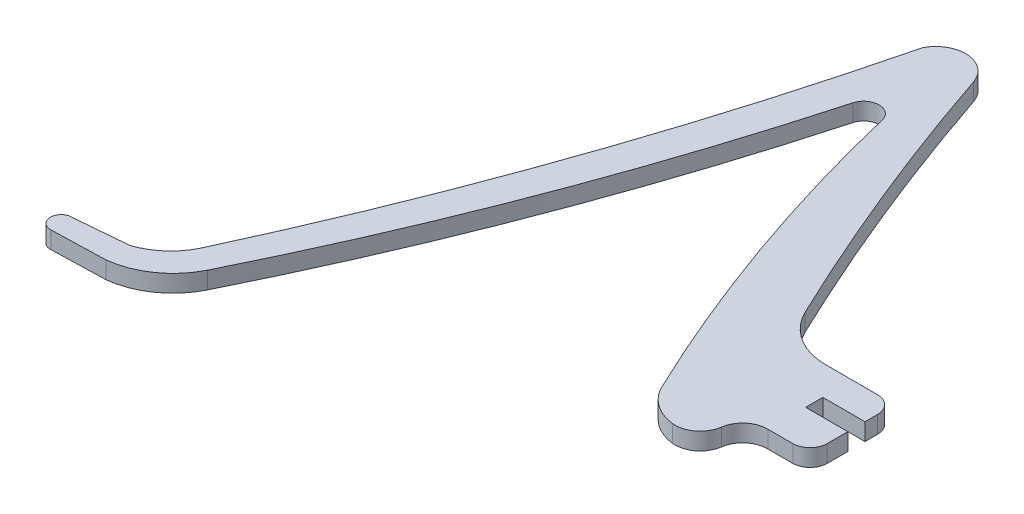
ISO-10303-21;
HEADER;
FILE_DESCRIPTION(('STEP AP214'),'2;1');
FILE_NAME('part.step','',(''),(''),'','','');
FILE_SCHEMA(('AUTOMOTIVE_DESIGN { 1 0 10303 214 1 1 1 1 }'));
ENDSEC;
DATA;
#1=APPLICATION_CONTEXT('core data for automotive mechanical design processes');
#2=APPLICATION_PROTOCOL_DEFINITION('international standard','automotive_design',2000,#1);
#3=PRODUCT_CONTEXT('',#1,'mechanical');
#4=PRODUCT('Part','Part','',(#3));
#5=PRODUCT_RELATED_PRODUCT_CATEGORY('part','',(#4));
#6=PRODUCT_DEFINITION_FORMATION('','',#4);
#7=PRODUCT_DEFINITION_CONTEXT('part definition',#1,'design');
#8=PRODUCT_DEFINITION('design','',#6,#7);
#9=PRODUCT_DEFINITION_SHAPE('','',#8);
#10=(LENGTH_UNIT() NAMED_UNIT(*) SI_UNIT(.MILLI.,.METRE.));
#11=(NAMED_UNIT(*) PLANE_ANGLE_UNIT() SI_UNIT($,.RADIAN.));
#12=(NAMED_UNIT(*) SI_UNIT($,.STERADIAN.) SOLID_ANGLE_UNIT());
#13=UNCERTAINTY_MEASURE_WITH_UNIT(LENGTH_MEASURE(1.E-05),#10,'distance_accuracy_value','');
#14=(GEOMETRIC_REPRESENTATION_CONTEXT(3) GLOBAL_UNCERTAINTY_ASSIGNED_CONTEXT((#13)) GLOBAL_UNIT_ASSIGNED_CONTEXT((#10,
#11,#12)) REPRESENTATION_CONTEXT('',''));
#15=CARTESIAN_POINT('',(0.,0.,0.));
#16=DIRECTION('',(0.,0.,1.));
#17=DIRECTION('',(1.,0.,0.));
#18=AXIS2_PLACEMENT_3D('',#15,#16,#17);
#19=CARTESIAN_POINT('',(-41736.5703119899,3.,-18202.859375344));
#20=DIRECTION('',(0.,-1.,0.));
#21=DIRECTION('',(0.,0.,-1.));
#22=AXIS2_PLACEMENT_3D('',#19,#20,#21);
#23=CYLINDRICAL_SURFACE('',#22,1.87725099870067);
#24=CARTESIAN_POINT('',(-41736.5703119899,0.,-18202.859375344));
#25=DIRECTION('',(0.,1.,0.));
#26=DIRECTION('',(0.,0.,1.));
#27=AXIS2_PLACEMENT_3D('',#24,#25,#26);
#28=CIRCLE('',#27,1.87725099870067);
#29=CARTESIAN_POINT('',(-41736.402871,0.,-18204.729144));
#30=VERTEX_POINT('',#29);
#31=CARTESIAN_POINT('',(-41736.517584,0.,-18200.982865));
#32=VERTEX_POINT('',#31);
#33=EDGE_CURVE('E228',#30,#32,#28,.T.);
#34=ORIENTED_EDGE('',*,*,#33,.T.);
#35=DIRECTION('',(0.,-1.,0.));
#36=VECTOR('',#35,1.);
#37=CARTESIAN_POINT('',(-41736.517584,3.,-18200.982865));
#38=LINE('',#37,#36);
#39=CARTESIAN_POINT('',(-41736.517584,3.,-18200.982865));
#40=VERTEX_POINT('',#39);
#41=EDGE_CURVE('E11',#40,#32,#38,.T.);
#42=ORIENTED_EDGE('',*,*,#41,.F.);
#43=CARTESIAN_POINT('',(-41736.5703119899,3.,-18202.859375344));
#44=DIRECTION('',(0.,1.,0.));
#45=DIRECTION('',(0.,0.,1.));
#46=AXIS2_PLACEMENT_3D('',#43,#44,#45);
#47=CIRCLE('',#46,1.87725099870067);
#48=CARTESIAN_POINT('',(-41736.402871,3.,-18204.729144));
#49=VERTEX_POINT('',#48);
#50=EDGE_CURVE('E274',#49,#40,#47,.T.);
#51=ORIENTED_EDGE('',*,*,#50,.F.);
#52=DIRECTION('',(0.,-1.,0.));
#53=VECTOR('',#52,1.);
#54=CARTESIAN_POINT('',(-41736.402871,3.,-18204.729144));
#55=LINE('',#54,#53);
#56=EDGE_CURVE('E224',#49,#30,#55,.T.);
#57=ORIENTED_EDGE('',*,*,#56,.T.);
#58=EDGE_LOOP('',(#34,#42,#51,#57));
#59=FACE_BOUND('',#58,.T.);
#60=ADVANCED_FACE('F36',(#59),#23,.T.);
#61=CARTESIAN_POINT('',(-41736.517584,3.,-18200.982865));
#62=DIRECTION('',(-0.0281516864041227,0.,-0.999603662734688));
#63=DIRECTION('',(-0.999603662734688,0.,0.0281516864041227));
#64=AXIS2_PLACEMENT_3D('',#61,#62,#63);
#65=PLANE('',#64);
#66=DIRECTION('',(0.999603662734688,0.,-0.0281516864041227));
#67=VECTOR('',#66,1.);
#68=CARTESIAN_POINT('',(-41736.517584,0.,-18200.982865));
#69=LINE('',#68,#67);
#70=CARTESIAN_POINT('',(-41727.101562,0.,-18201.248047));
#71=VERTEX_POINT('',#70);
#72=EDGE_CURVE('E231',#32,#71,#69,.T.);
#73=ORIENTED_EDGE('',*,*,#72,.T.);
#74=DIRECTION('',(0.,-1.,0.));
#75=VECTOR('',#74,1.);
#76=CARTESIAN_POINT('',(-41727.101562,3.,-18201.248047));
#77=LINE('',#76,#75);
#78=CARTESIAN_POINT('',(-41727.101562,3.,-18201.248047));
#79=VERTEX_POINT('',#78);
#80=EDGE_CURVE('E44',#79,#71,#77,.T.);
#81=ORIENTED_EDGE('',*,*,#80,.F.);
#82=DIRECTION('',(0.999603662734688,0.,-0.0281516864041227));
#83=VECTOR('',#82,1.);
#84=CARTESIAN_POINT('',(-41736.517584,3.,-18200.982865));
#85=LINE('',#84,#83);
#86=EDGE_CURVE('E143',#40,#79,#85,.T.);
#87=ORIENTED_EDGE('',*,*,#86,.F.);
#88=ORIENTED_EDGE('',*,*,#41,.T.);
#89=EDGE_LOOP('',(#73,#81,#87,#88));
#90=FACE_BOUND('',#89,.T.);
#91=ADVANCED_FACE('F412',(#90),#65,.F.);
#92=CARTESIAN_POINT('',(-41728.6495248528,3.,-18214.4523570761));
#93=DIRECTION('',(0.,-1.,0.));
#94=DIRECTION('',(0.,0.,-1.));
#95=AXIS2_PLACEMENT_3D('',#92,#93,#94);
#96=CYLINDRICAL_SURFACE('',#95,13.2947355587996);
#97=CARTESIAN_POINT('',(-41728.6495248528,0.,-18214.4523570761));
#98=DIRECTION('',(0.,1.,0.));
#99=DIRECTION('',(0.,0.,1.));
#100=AXIS2_PLACEMENT_3D('',#97,#98,#99);
#101=CIRCLE('',#100,13.2947355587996);
#102=CARTESIAN_POINT('',(-41716.7257579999,0.,-18208.57241));
#103=VERTEX_POINT('',#102);
#104=EDGE_CURVE('E233',#71,#103,#101,.T.);
#105=ORIENTED_EDGE('',*,*,#104,.T.);
#106=DIRECTION('',(0.,-1.,0.));
#107=VECTOR('',#106,1.);
#108=CARTESIAN_POINT('',(-41716.7257579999,3.,-18208.57241));
#109=LINE('',#108,#107);
#110=CARTESIAN_POINT('',(-41716.7257579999,3.,-18208.57241));
#111=VERTEX_POINT('',#110);
#112=EDGE_CURVE('E329',#111,#103,#109,.T.);
#113=ORIENTED_EDGE('',*,*,#112,.F.);
#114=CARTESIAN_POINT('',(-41728.6495248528,3.,-18214.4523570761));
#115=DIRECTION('',(0.,1.,0.));
#116=DIRECTION('',(0.,0.,1.));
#117=AXIS2_PLACEMENT_3D('',#114,#115,#116);
#118=CIRCLE('',#117,13.2947355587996);
#119=EDGE_CURVE('E337',#79,#111,#118,.T.);
#120=ORIENTED_EDGE('',*,*,#119,.F.);
#121=ORIENTED_EDGE('',*,*,#80,.T.);
#122=EDGE_LOOP('',(#105,#113,#120,#121));
#123=FACE_BOUND('',#122,.T.);
#124=ADVANCED_FACE('F335',(#123),#96,.T.);
#125=CARTESIAN_POINT('',(-42129.610875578,3.,-18412.1957815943));
#126=DIRECTION('',(0.,-1.,0.));
#127=DIRECTION('',(0.,0.,-1.));
#128=AXIS2_PLACEMENT_3D('',#125,#126,#127);
#129=CYLINDRICAL_SURFACE('',#128,460.365721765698);
#130=CARTESIAN_POINT('',(-42129.610875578,0.,-18412.1957815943));
#131=DIRECTION('',(0.,1.,0.));
#132=DIRECTION('',(0.,0.,1.));
#133=AXIS2_PLACEMENT_3D('',#130,#131,#132);
#134=CIRCLE('',#133,460.365721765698);
#135=CARTESIAN_POINT('',(-41685.712916,0.,-18290.1662800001));
#136=VERTEX_POINT('',#135);
#137=EDGE_CURVE('E235',#103,#136,#134,.T.);
#138=ORIENTED_EDGE('',*,*,#137,.T.);
#139=DIRECTION('',(0.,-1.,0.));
#140=VECTOR('',#139,1.);
#141=CARTESIAN_POINT('',(-41685.712916,3.,-18290.1662800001));
#142=LINE('',#141,#140);
#143=CARTESIAN_POINT('',(-41685.712916,3.,-18290.1662800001));
#144=VERTEX_POINT('',#143);
#145=EDGE_CURVE('E326',#144,#136,#142,.T.);
#146=ORIENTED_EDGE('',*,*,#145,.F.);
#147=CARTESIAN_POINT('',(-42129.610875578,3.,-18412.1957815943));
#148=DIRECTION('',(0.,1.,0.));
#149=DIRECTION('',(0.,0.,1.));
#150=AXIS2_PLACEMENT_3D('',#147,#148,#149);
#151=CIRCLE('',#150,460.365721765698);
#152=EDGE_CURVE('E355',#111,#144,#151,.T.);
#153=ORIENTED_EDGE('',*,*,#152,.F.);
#154=ORIENTED_EDGE('',*,*,#112,.T.);
#155=EDGE_LOOP('',(#138,#146,#153,#154));
#156=FACE_BOUND('',#155,.T.);
#157=ADVANCED_FACE('F346',(#156),#129,.T.);
#158=CARTESIAN_POINT('',(-41683.1202207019,3.,-18289.4531815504));
#159=DIRECTION('',(0.,-1.,0.));
#160=DIRECTION('',(0.,0.,-1.));
#161=AXIS2_PLACEMENT_3D('',#158,#159,#160);
#162=CYLINDRICAL_SURFACE('',#161,2.68897346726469);
#163=CARTESIAN_POINT('',(-41683.1202207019,0.,-18289.4531815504));
#164=DIRECTION('',(0.,-1.,0.));
#165=DIRECTION('',(0.,0.,1.));
#166=AXIS2_PLACEMENT_3D('',#163,#164,#165);
#167=CIRCLE('',#166,2.68897346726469);
#168=CARTESIAN_POINT('',(-41680.641146,0.,-18290.494703));
#169=VERTEX_POINT('',#168);
#170=EDGE_CURVE('E237',#136,#169,#167,.T.);
#171=ORIENTED_EDGE('',*,*,#170,.T.);
#172=DIRECTION('',(0.,-1.,0.));
#173=VECTOR('',#172,1.);
#174=CARTESIAN_POINT('',(-41680.641146,3.,-18290.494703));
#175=LINE('',#174,#173);
#176=CARTESIAN_POINT('',(-41680.641146,3.,-18290.494703));
#177=VERTEX_POINT('',#176);
#178=EDGE_CURVE('E323',#177,#169,#175,.T.);
#179=ORIENTED_EDGE('',*,*,#178,.F.);
#180=CARTESIAN_POINT('',(-41683.1202207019,3.,-18289.4531815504));
#181=DIRECTION('',(0.,-1.,0.));
#182=DIRECTION('',(0.,0.,1.));
#183=AXIS2_PLACEMENT_3D('',#180,#181,#182);
#184=CIRCLE('',#183,2.68897346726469);
#185=EDGE_CURVE('E352',#144,#177,#184,.T.);
#186=ORIENTED_EDGE('',*,*,#185,.F.);
#187=ORIENTED_EDGE('',*,*,#145,.T.);
#188=EDGE_LOOP('',(#171,#179,#186,#187));
#189=FACE_BOUND('',#188,.T.);
#190=ADVANCED_FACE('F350',(#189),#162,.F.);
#191=CARTESIAN_POINT('',(-41388.5252984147,3.,-18360.1380724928));
#192=DIRECTION('',(0.,-1.,0.));
#193=DIRECTION('',(0.,0.,-1.));
#194=AXIS2_PLACEMENT_3D('',#191,#192,#193);
#195=CYLINDRICAL_SURFACE('',#194,300.302959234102);
#196=CARTESIAN_POINT('',(-41388.5252984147,0.,-18360.1380724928));
#197=DIRECTION('',(0.,1.,0.));
#198=DIRECTION('',(0.,0.,1.));
#199=AXIS2_PLACEMENT_3D('',#196,#197,#198);
#200=CIRCLE('',#199,300.302959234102);
#201=CARTESIAN_POINT('',(-41659.432339,0.,-18230.5570450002));
#202=VERTEX_POINT('',#201);
#203=EDGE_CURVE('E239',#169,#202,#200,.T.);
#204=ORIENTED_EDGE('',*,*,#203,.T.);
#205=DIRECTION('',(0.,-1.,0.));
#206=VECTOR('',#205,1.);
#207=CARTESIAN_POINT('',(-41659.432339,3.,-18230.5570450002));
#208=LINE('',#207,#206);
#209=CARTESIAN_POINT('',(-41659.432339,3.,-18230.5570450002));
#210=VERTEX_POINT('',#209);
#211=EDGE_CURVE('E320',#210,#202,#208,.T.);
#212=ORIENTED_EDGE('',*,*,#211,.F.);
#213=CARTESIAN_POINT('',(-41388.5252984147,3.,-18360.1380724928));
#214=DIRECTION('',(0.,1.,0.));
#215=DIRECTION('',(0.,0.,1.));
#216=AXIS2_PLACEMENT_3D('',#213,#214,#215);
#217=CIRCLE('',#216,300.302959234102);
#218=EDGE_CURVE('E354',#177,#210,#217,.T.);
#219=ORIENTED_EDGE('',*,*,#218,.F.);
#220=ORIENTED_EDGE('',*,*,#178,.T.);
#221=EDGE_LOOP('',(#204,#212,#219,#220));
#222=FACE_BOUND('',#221,.T.);
#223=ADVANCED_FACE('F425',(#222),#195,.T.);
#224=CARTESIAN_POINT('',(-41652.049504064,3.,-18234.0869775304));
#225=DIRECTION('',(0.,-1.,0.));
#226=DIRECTION('',(0.,0.,-1.));
#227=AXIS2_PLACEMENT_3D('',#224,#225,#226);
#228=CYLINDRICAL_SURFACE('',#227,8.18331689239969);
#229=CARTESIAN_POINT('',(-41652.049504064,0.,-18234.0869775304));
#230=DIRECTION('',(0.,1.,0.));
#231=DIRECTION('',(0.,0.,1.));
#232=AXIS2_PLACEMENT_3D('',#229,#230,#231);
#233=CIRCLE('',#232,8.18331689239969);
#234=CARTESIAN_POINT('',(-41653.00576,0.,-18225.9597240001));
#235=VERTEX_POINT('',#234);
#236=EDGE_CURVE('E241',#202,#235,#233,.T.);
#237=ORIENTED_EDGE('',*,*,#236,.T.);
#238=DIRECTION('',(0.,-1.,0.));
#239=VECTOR('',#238,1.);
#240=CARTESIAN_POINT('',(-41653.00576,3.,-18225.9597240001));
#241=LINE('',#240,#239);
#242=CARTESIAN_POINT('',(-41653.00576,3.,-18225.9597240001));
#243=VERTEX_POINT('',#242);
#244=EDGE_CURVE('E317',#243,#235,#241,.T.);
#245=ORIENTED_EDGE('',*,*,#244,.F.);
#246=CARTESIAN_POINT('',(-41652.049504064,3.,-18234.0869775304));
#247=DIRECTION('',(0.,1.,0.));
#248=DIRECTION('',(0.,0.,1.));
#249=AXIS2_PLACEMENT_3D('',#246,#247,#248);
#250=CIRCLE('',#249,8.18331689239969);
#251=EDGE_CURVE('E357',#210,#243,#250,.T.);
#252=ORIENTED_EDGE('',*,*,#251,.F.);
#253=ORIENTED_EDGE('',*,*,#211,.T.);
#254=EDGE_LOOP('',(#237,#245,#252,#253));
#255=FACE_BOUND('',#254,.T.);
#256=ADVANCED_FACE('F428',(#255),#228,.T.);
#257=CARTESIAN_POINT('',(-41652.4920338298,3.,-18230.2989458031));
#258=DIRECTION('',(0.,-1.,0.));
#259=DIRECTION('',(0.,0.,-1.));
#260=AXIS2_PLACEMENT_3D('',#257,#258,#259);
#261=CYLINDRICAL_SURFACE('',#260,4.36952633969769);
#262=CARTESIAN_POINT('',(-41652.4920338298,0.,-18230.2989458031));
#263=DIRECTION('',(0.,1.,0.));
#264=DIRECTION('',(0.,0.,1.));
#265=AXIS2_PLACEMENT_3D('',#262,#263,#264);
#266=CIRCLE('',#265,4.36952633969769);
#267=CARTESIAN_POINT('',(-41648.166319,0.,-18229.681733));
#268=VERTEX_POINT('',#267);
#269=EDGE_CURVE('E243',#235,#268,#266,.T.);
#270=ORIENTED_EDGE('',*,*,#269,.T.);
#271=DIRECTION('',(0.,-1.,0.));
#272=VECTOR('',#271,1.);
#273=CARTESIAN_POINT('',(-41648.166319,3.,-18229.681733));
#274=LINE('',#273,#272);
#275=CARTESIAN_POINT('',(-41648.166319,3.,-18229.681733));
#276=VERTEX_POINT('',#275);
#277=EDGE_CURVE('E314',#276,#268,#274,.T.);
#278=ORIENTED_EDGE('',*,*,#277,.F.);
#279=CARTESIAN_POINT('',(-41652.4920338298,3.,-18230.2989458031));
#280=DIRECTION('',(0.,1.,0.));
#281=DIRECTION('',(0.,0.,1.));
#282=AXIS2_PLACEMENT_3D('',#279,#280,#281);
#283=CIRCLE('',#282,4.36952633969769);
#284=EDGE_CURVE('E363',#243,#276,#283,.T.);
#285=ORIENTED_EDGE('',*,*,#284,.F.);
#286=ORIENTED_EDGE('',*,*,#244,.T.);
#287=EDGE_LOOP('',(#270,#278,#285,#286));
#288=FACE_BOUND('',#287,.T.);
#289=ADVANCED_FACE('F432',(#288),#261,.T.);
#290=CARTESIAN_POINT('',(-41643.8549400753,3.,-18229.0668609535));
#291=DIRECTION('',(0.,-1.,0.));
#292=DIRECTION('',(0.,0.,-1.));
#293=AXIS2_PLACEMENT_3D('',#290,#291,#292);
#294=CYLINDRICAL_SURFACE('',#293,4.35500354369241);
#295=CARTESIAN_POINT('',(-41643.8549400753,0.,-18229.0668609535));
#296=DIRECTION('',(0.,-1.,0.));
#297=DIRECTION('',(0.,0.,1.));
#298=AXIS2_PLACEMENT_3D('',#295,#296,#297);
#299=CIRCLE('',#298,4.35500354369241);
#300=CARTESIAN_POINT('',(-41643.818257,0.,-18233.42171));
#301=VERTEX_POINT('',#300);
#302=EDGE_CURVE('E245',#268,#301,#299,.T.);
#303=ORIENTED_EDGE('',*,*,#302,.T.);
#304=DIRECTION('',(0.,-1.,0.));
#305=VECTOR('',#304,1.);
#306=CARTESIAN_POINT('',(-41643.818257,3.,-18233.42171));
#307=LINE('',#306,#305);
#308=CARTESIAN_POINT('',(-41643.818257,3.,-18233.42171));
#309=VERTEX_POINT('',#308);
#310=EDGE_CURVE('E311',#309,#301,#307,.T.);
#311=ORIENTED_EDGE('',*,*,#310,.F.);
#312=CARTESIAN_POINT('',(-41643.8549400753,3.,-18229.0668609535));
#313=DIRECTION('',(0.,-1.,0.));
#314=DIRECTION('',(0.,0.,1.));
#315=AXIS2_PLACEMENT_3D('',#312,#313,#314);
#316=CIRCLE('',#315,4.35500354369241);
#317=EDGE_CURVE('E365',#276,#309,#316,.T.);
#318=ORIENTED_EDGE('',*,*,#317,.F.);
#319=ORIENTED_EDGE('',*,*,#277,.T.);
#320=EDGE_LOOP('',(#303,#311,#318,#319));
#321=FACE_BOUND('',#320,.T.);
#322=ADVANCED_FACE('F436',(#321),#294,.F.);
#323=CARTESIAN_POINT('',(-41643.818257,3.,-18233.42171));
#324=DIRECTION('',(-0.000483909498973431,0.,-0.999999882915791));
#325=DIRECTION('',(-0.999999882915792,0.,0.000483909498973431));
#326=AXIS2_PLACEMENT_3D('',#323,#324,#325);
#327=PLANE('',#326);
#328=DIRECTION('',(0.999999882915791,0.,-0.000483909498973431));
#329=VECTOR('',#328,1.);
#330=CARTESIAN_POINT('',(-41643.818257,0.,-18233.42171));
#331=LINE('',#330,#329);
#332=CARTESIAN_POINT('',(-41639.441406,0.,-18233.423828));
#333=VERTEX_POINT('',#332);
#334=EDGE_CURVE('E247',#301,#333,#331,.T.);
#335=ORIENTED_EDGE('',*,*,#334,.T.);
#336=DIRECTION('',(0.,-1.,0.));
#337=VECTOR('',#336,1.);
#338=CARTESIAN_POINT('',(-41639.441406,3.,-18233.423828));
#339=LINE('',#338,#337);
#340=CARTESIAN_POINT('',(-41639.441406,3.,-18233.423828));
#341=VERTEX_POINT('',#340);
#342=EDGE_CURVE('E308',#341,#333,#339,.T.);
#343=ORIENTED_EDGE('',*,*,#342,.F.);
#344=DIRECTION('',(0.999999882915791,0.,-0.000483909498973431));
#345=VECTOR('',#344,1.);
#346=CARTESIAN_POINT('',(-41643.818257,3.,-18233.42171));
#347=LINE('',#346,#345);
#348=EDGE_CURVE('E367',#309,#341,#347,.T.);
#349=ORIENTED_EDGE('',*,*,#348,.F.);
#350=ORIENTED_EDGE('',*,*,#310,.T.);
#351=EDGE_LOOP('',(#335,#343,#349,#350));
#352=FACE_BOUND('',#351,.T.);
#353=ADVANCED_FACE('F440',(#352),#327,.F.);
#354=CARTESIAN_POINT('',(-41639.4423819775,3.,-18236.4248038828));
#355=DIRECTION('',(0.,-1.,0.));
#356=DIRECTION('',(0.,0.,-1.));
#357=AXIS2_PLACEMENT_3D('',#354,#355,#356);
#358=CYLINDRICAL_SURFACE('',#357,3.00097604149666);
#359=CARTESIAN_POINT('',(-41639.4423819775,0.,-18236.4248038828));
#360=DIRECTION('',(0.,1.,0.));
#361=DIRECTION('',(0.,0.,1.));
#362=AXIS2_PLACEMENT_3D('',#359,#360,#361);
#363=CIRCLE('',#362,3.00097604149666);
#364=CARTESIAN_POINT('',(-41636.441407,0.,-18236.427331));
#365=VERTEX_POINT('',#364);
#366=EDGE_CURVE('E249',#333,#365,#363,.T.);
#367=ORIENTED_EDGE('',*,*,#366,.T.);
#368=DIRECTION('',(0.,-1.,0.));
#369=VECTOR('',#368,1.);
#370=CARTESIAN_POINT('',(-41636.441407,3.,-18236.427331));
#371=LINE('',#370,#369);
#372=CARTESIAN_POINT('',(-41636.441407,3.,-18236.427331));
#373=VERTEX_POINT('',#372);
#374=EDGE_CURVE('E305',#373,#365,#371,.T.);
#375=ORIENTED_EDGE('',*,*,#374,.F.);
#376=CARTESIAN_POINT('',(-41639.4423819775,3.,-18236.4248038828));
#377=DIRECTION('',(0.,1.,0.));
#378=DIRECTION('',(0.,0.,1.));
#379=AXIS2_PLACEMENT_3D('',#376,#377,#378);
#380=CIRCLE('',#379,3.00097604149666);
#381=EDGE_CURVE('E369',#341,#373,#380,.T.);
#382=ORIENTED_EDGE('',*,*,#381,.F.);
#383=ORIENTED_EDGE('',*,*,#342,.T.);
#384=EDGE_LOOP('',(#367,#375,#382,#383));
#385=FACE_BOUND('',#384,.T.);
#386=ADVANCED_FACE('F444',(#385),#358,.T.);
#387=CARTESIAN_POINT('',(-41636.441407,3.,-18236.427331));
#388=DIRECTION('',(-0.999999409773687,0.,0.00108648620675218));
#389=DIRECTION('',(0.00108648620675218,0.,0.999999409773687));
#390=AXIS2_PLACEMENT_3D('',#387,#388,#389);
#391=PLANE('',#390);
#392=DIRECTION('',(-0.00108648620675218,0.,-0.999999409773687));
#393=VECTOR('',#392,1.);
#394=CARTESIAN_POINT('',(-41636.441407,0.,-18236.427331));
#395=LINE('',#394,#393);
#396=CARTESIAN_POINT('',(-41636.445312,0.,-18240.021484));
#397=VERTEX_POINT('',#396);
#398=EDGE_CURVE('E251',#365,#397,#395,.T.);
#399=ORIENTED_EDGE('',*,*,#398,.T.);
#400=DIRECTION('',(0.,-1.,0.));
#401=VECTOR('',#400,1.);
#402=CARTESIAN_POINT('',(-41636.445312,3.,-18240.021484));
#403=LINE('',#402,#401);
#404=CARTESIAN_POINT('',(-41636.445312,3.,-18240.021484));
#405=VERTEX_POINT('',#404);
#406=EDGE_CURVE('E302',#405,#397,#403,.T.);
#407=ORIENTED_EDGE('',*,*,#406,.F.);
#408=DIRECTION('',(-0.00108648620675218,0.,-0.999999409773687));
#409=VECTOR('',#408,1.);
#410=CARTESIAN_POINT('',(-41636.441407,3.,-18236.427331));
#411=LINE('',#410,#409);
#412=EDGE_CURVE('E371',#373,#405,#411,.T.);
#413=ORIENTED_EDGE('',*,*,#412,.F.);
#414=ORIENTED_EDGE('',*,*,#374,.T.);
#415=EDGE_LOOP('',(#399,#407,#413,#414));
#416=FACE_BOUND('',#415,.T.);
#417=ADVANCED_FACE('F448',(#416),#391,.F.);
#418=CARTESIAN_POINT('',(-41636.445312,3.,-18240.021484));
#419=DIRECTION('',(0.,0.,1.));
#420=DIRECTION('',(1.,0.,0.));
#421=AXIS2_PLACEMENT_3D('',#418,#419,#420);
#422=PLANE('',#421);
#423=DIRECTION('',(-1.,0.,0.));
#424=VECTOR('',#423,1.);
#425=CARTESIAN_POINT('',(-41636.445312,0.,-18240.021484));
#426=LINE('',#425,#424);
#427=CARTESIAN_POINT('',(-41643.804687,0.,-18240.021484));
#428=VERTEX_POINT('',#427);
#429=EDGE_CURVE('E253',#397,#428,#426,.T.);
#430=ORIENTED_EDGE('',*,*,#429,.T.);
#431=DIRECTION('',(0.,-1.,0.));
#432=VECTOR('',#431,1.);
#433=CARTESIAN_POINT('',(-41643.804687,3.,-18240.021484));
#434=LINE('',#433,#432);
#435=CARTESIAN_POINT('',(-41643.804687,3.,-18240.021484));
#436=VERTEX_POINT('',#435);
#437=EDGE_CURVE('E299',#436,#428,#434,.T.);
#438=ORIENTED_EDGE('',*,*,#437,.F.);
#439=DIRECTION('',(-1.,0.,0.));
#440=VECTOR('',#439,1.);
#441=CARTESIAN_POINT('',(-41636.445312,3.,-18240.021484));
#442=LINE('',#441,#440);
#443=EDGE_CURVE('E373',#405,#436,#442,.T.);
#444=ORIENTED_EDGE('',*,*,#443,.F.);
#445=ORIENTED_EDGE('',*,*,#406,.T.);
#446=EDGE_LOOP('',(#430,#438,#444,#445));
#447=FACE_BOUND('',#446,.T.);
#448=ADVANCED_FACE('F452',(#447),#422,.F.);
#449=CARTESIAN_POINT('',(-41643.804687,3.,-18240.021484));
#450=DIRECTION('',(-0.999999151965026,0.,0.00130233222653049));
#451=DIRECTION('',(0.00130233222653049,0.,0.999999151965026));
#452=AXIS2_PLACEMENT_3D('',#449,#450,#451);
#453=PLANE('',#452);
#454=DIRECTION('',(-0.00130233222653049,0.,-0.999999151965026));
#455=VECTOR('',#454,1.);
#456=CARTESIAN_POINT('',(-41643.804687,0.,-18240.021484));
#457=LINE('',#456,#455);
#458=CARTESIAN_POINT('',(-41643.808594,0.,-18243.021484));
#459=VERTEX_POINT('',#458);
#460=EDGE_CURVE('E255',#428,#459,#457,.T.);
#461=ORIENTED_EDGE('',*,*,#460,.T.);
#462=DIRECTION('',(0.,-1.,0.));
#463=VECTOR('',#462,1.);
#464=CARTESIAN_POINT('',(-41643.808594,3.,-18243.021484));
#465=LINE('',#464,#463);
#466=CARTESIAN_POINT('',(-41643.808594,3.,-18243.021484));
#467=VERTEX_POINT('',#466);
#468=EDGE_CURVE('E296',#467,#459,#465,.T.);
#469=ORIENTED_EDGE('',*,*,#468,.F.);
#470=DIRECTION('',(-0.00130233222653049,0.,-0.999999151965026));
#471=VECTOR('',#470,1.);
#472=CARTESIAN_POINT('',(-41643.804687,3.,-18240.021484));
#473=LINE('',#472,#471);
#474=EDGE_CURVE('E375',#436,#467,#473,.T.);
#475=ORIENTED_EDGE('',*,*,#474,.F.);
#476=ORIENTED_EDGE('',*,*,#437,.T.);
#477=EDGE_LOOP('',(#461,#469,#475,#476));
#478=FACE_BOUND('',#477,.T.);
#479=ADVANCED_FACE('F456',(#478),#453,.F.);
#480=CARTESIAN_POINT('',(-41643.808594,3.,-18243.021484));
#481=DIRECTION('',(0.,0.,-1.));
#482=DIRECTION('',(-1.,0.,0.));
#483=AXIS2_PLACEMENT_3D('',#480,#481,#482);
#484=PLANE('',#483);
#485=DIRECTION('',(1.,0.,0.));
#486=VECTOR('',#485,1.);
#487=CARTESIAN_POINT('',(-41643.808594,0.,-18243.021484));
#488=LINE('',#487,#486);
#489=CARTESIAN_POINT('',(-41636.449219,0.,-18243.021484));
#490=VERTEX_POINT('',#489);
#491=EDGE_CURVE('E257',#459,#490,#488,.T.);
#492=ORIENTED_EDGE('',*,*,#491,.T.);
#493=DIRECTION('',(0.,-1.,0.));
#494=VECTOR('',#493,1.);
#495=CARTESIAN_POINT('',(-41636.449219,3.,-18243.021484));
#496=LINE('',#495,#494);
#497=CARTESIAN_POINT('',(-41636.449219,3.,-18243.021484));
#498=VERTEX_POINT('',#497);
#499=EDGE_CURVE('E293',#498,#490,#496,.T.);
#500=ORIENTED_EDGE('',*,*,#499,.F.);
#501=DIRECTION('',(1.,0.,0.));
#502=VECTOR('',#501,1.);
#503=CARTESIAN_POINT('',(-41643.808594,3.,-18243.021484));
#504=LINE('',#503,#502);
#505=EDGE_CURVE('E377',#467,#498,#504,.T.);
#506=ORIENTED_EDGE('',*,*,#505,.F.);
#507=ORIENTED_EDGE('',*,*,#468,.T.);
#508=EDGE_LOOP('',(#492,#500,#506,#507));
#509=FACE_BOUND('',#508,.T.);
#510=ADVANCED_FACE('F460',(#509),#484,.F.);
#511=CARTESIAN_POINT('',(-41636.449219,3.,-18243.021484));
#512=DIRECTION('',(-0.999998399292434,0.,-0.00178924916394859));
#513=DIRECTION('',(-0.00178924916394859,0.,0.999998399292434));
#514=AXIS2_PLACEMENT_3D('',#511,#512,#513);
#515=PLANE('',#514);
#516=DIRECTION('',(0.00178924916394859,0.,-0.999998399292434));
#517=VECTOR('',#516,1.);
#518=CARTESIAN_POINT('',(-41636.449219,0.,-18243.021484));
#519=LINE('',#518,#517);
#520=CARTESIAN_POINT('',(-41636.445312,0.,-18245.205078));
#521=VERTEX_POINT('',#520);
#522=EDGE_CURVE('E259',#490,#521,#519,.T.);
#523=ORIENTED_EDGE('',*,*,#522,.T.);
#524=DIRECTION('',(0.,-1.,0.));
#525=VECTOR('',#524,1.);
#526=CARTESIAN_POINT('',(-41636.445312,3.,-18245.205078));
#527=LINE('',#526,#525);
#528=CARTESIAN_POINT('',(-41636.445312,3.,-18245.205078));
#529=VERTEX_POINT('',#528);
#530=EDGE_CURVE('E290',#529,#521,#527,.T.);
#531=ORIENTED_EDGE('',*,*,#530,.F.);
#532=DIRECTION('',(0.00178924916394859,0.,-0.999998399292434));
#533=VECTOR('',#532,1.);
#534=CARTESIAN_POINT('',(-41636.449219,3.,-18243.021484));
#535=LINE('',#534,#533);
#536=EDGE_CURVE('E379',#498,#529,#535,.T.);
#537=ORIENTED_EDGE('',*,*,#536,.F.);
#538=ORIENTED_EDGE('',*,*,#499,.T.);
#539=EDGE_LOOP('',(#523,#531,#537,#538));
#540=FACE_BOUND('',#539,.T.);
#541=ADVANCED_FACE('F464',(#540),#515,.F.);
#542=CARTESIAN_POINT('',(-41639.445312,3.,-18245.205078));
#543=DIRECTION('',(0.,-1.,0.));
#544=DIRECTION('',(0.,0.,-1.));
#545=AXIS2_PLACEMENT_3D('',#542,#543,#544);
#546=CYLINDRICAL_SURFACE('',#545,3.0000000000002);
#547=CARTESIAN_POINT('',(-41639.445312,0.,-18245.205078));
#548=DIRECTION('',(0.,1.,0.));
#549=DIRECTION('',(0.,0.,1.));
#550=AXIS2_PLACEMENT_3D('',#547,#548,#549);
#551=CIRCLE('',#550,3.0000000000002);
#552=CARTESIAN_POINT('',(-41639.445313,0.,-18248.205078));
#553=VERTEX_POINT('',#552);
#554=EDGE_CURVE('E261',#521,#553,#551,.T.);
#555=ORIENTED_EDGE('',*,*,#554,.T.);
#556=DIRECTION('',(0.,-1.,0.));
#557=VECTOR('',#556,1.);
#558=CARTESIAN_POINT('',(-41639.445313,3.,-18248.205078));
#559=LINE('',#558,#557);
#560=CARTESIAN_POINT('',(-41639.445313,3.,-18248.205078));
#561=VERTEX_POINT('',#560);
#562=EDGE_CURVE('E287',#561,#553,#559,.T.);
#563=ORIENTED_EDGE('',*,*,#562,.F.);
#564=CARTESIAN_POINT('',(-41639.445312,3.,-18245.205078));
#565=DIRECTION('',(0.,1.,0.));
#566=DIRECTION('',(0.,0.,1.));
#567=AXIS2_PLACEMENT_3D('',#564,#565,#566);
#568=CIRCLE('',#567,3.0000000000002);
#569=EDGE_CURVE('E381',#529,#561,#568,.T.);
#570=ORIENTED_EDGE('',*,*,#569,.F.);
#571=ORIENTED_EDGE('',*,*,#530,.T.);
#572=EDGE_LOOP('',(#555,#563,#570,#571));
#573=FACE_BOUND('',#572,.T.);
#574=ADVANCED_FACE('F468',(#573),#546,.T.);
#575=CARTESIAN_POINT('',(-41639.445313,3.,-18248.205078));
#576=DIRECTION('',(0.000209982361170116,0.,0.999999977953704));
#577=DIRECTION('',(0.999999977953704,0.,-0.000209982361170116));
#578=AXIS2_PLACEMENT_3D('',#575,#576,#577);
#579=PLANE('',#578);
#580=DIRECTION('',(-0.999999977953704,0.,0.000209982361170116));
#581=VECTOR('',#580,1.);
#582=CARTESIAN_POINT('',(-41639.445313,0.,-18248.205078));
#583=LINE('',#582,#581);
#584=CARTESIAN_POINT('',(-41648.746094,0.,-18248.203125));
#585=VERTEX_POINT('',#584);
#586=EDGE_CURVE('E263',#553,#585,#583,.T.);
#587=ORIENTED_EDGE('',*,*,#586,.T.);
#588=DIRECTION('',(0.,-1.,0.));
#589=VECTOR('',#588,1.);
#590=CARTESIAN_POINT('',(-41648.746094,3.,-18248.203125));
#591=LINE('',#590,#589);
#592=CARTESIAN_POINT('',(-41648.746094,3.,-18248.203125));
#593=VERTEX_POINT('',#592);
#594=EDGE_CURVE('E284',#593,#585,#591,.T.);
#595=ORIENTED_EDGE('',*,*,#594,.F.);
#596=DIRECTION('',(-0.999999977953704,0.,0.000209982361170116));
#597=VECTOR('',#596,1.);
#598=CARTESIAN_POINT('',(-41639.445313,3.,-18248.205078));
#599=LINE('',#598,#597);
#600=EDGE_CURVE('E383',#561,#593,#599,.T.);
#601=ORIENTED_EDGE('',*,*,#600,.F.);
#602=ORIENTED_EDGE('',*,*,#562,.T.);
#603=EDGE_LOOP('',(#587,#595,#601,#602));
#604=FACE_BOUND('',#603,.T.);
#605=ADVANCED_FACE('F472',(#604),#579,.F.);
#606=CARTESIAN_POINT('',(-41648.4418663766,3.,-18259.0563531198));
#607=DIRECTION('',(0.,-1.,0.));
#608=DIRECTION('',(0.,0.,-1.));
#609=AXIS2_PLACEMENT_3D('',#606,#607,#608);
#610=CYLINDRICAL_SURFACE('',#609,10.8574911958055);
#611=CARTESIAN_POINT('',(-41648.4418663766,0.,-18259.0563531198));
#612=DIRECTION('',(0.,-1.,0.));
#613=DIRECTION('',(0.,0.,1.));
#614=AXIS2_PLACEMENT_3D('',#611,#612,#613);
#615=CIRCLE('',#614,10.8574911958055);
#616=CARTESIAN_POINT('',(-41658.2392889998,0.,-18254.3770769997));
#617=VERTEX_POINT('',#616);
#618=EDGE_CURVE('E265',#585,#617,#615,.T.);
#619=ORIENTED_EDGE('',*,*,#618,.T.);
#620=DIRECTION('',(0.,-1.,0.));
#621=VECTOR('',#620,1.);
#622=CARTESIAN_POINT('',(-41658.2392889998,3.,-18254.3770769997));
#623=LINE('',#622,#621);
#624=CARTESIAN_POINT('',(-41658.2392889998,3.,-18254.3770769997));
#625=VERTEX_POINT('',#624);
#626=EDGE_CURVE('E281',#625,#617,#623,.T.);
#627=ORIENTED_EDGE('',*,*,#626,.F.);
#628=CARTESIAN_POINT('',(-41648.4418663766,3.,-18259.0563531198));
#629=DIRECTION('',(0.,-1.,0.));
#630=DIRECTION('',(0.,0.,1.));
#631=AXIS2_PLACEMENT_3D('',#628,#629,#630);
#632=CIRCLE('',#631,10.8574911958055);
#633=EDGE_CURVE('E385',#593,#625,#632,.T.);
#634=ORIENTED_EDGE('',*,*,#633,.F.);
#635=ORIENTED_EDGE('',*,*,#594,.T.);
#636=EDGE_LOOP('',(#619,#627,#634,#635));
#637=FACE_BOUND('',#636,.T.);
#638=ADVANCED_FACE('F476',(#637),#610,.F.);
#639=CARTESIAN_POINT('',(-41256.5940102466,3.,-18446.4104951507));
#640=DIRECTION('',(0.,-1.,0.));
#641=DIRECTION('',(0.,0.,-1.));
#642=AXIS2_PLACEMENT_3D('',#639,#640,#641);
#643=CYLINDRICAL_SURFACE('',#642,445.191827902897);
#644=CARTESIAN_POINT('',(-41256.5940102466,0.,-18446.4104951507));
#645=DIRECTION('',(0.,-1.,0.));
#646=DIRECTION('',(0.,0.,1.));
#647=AXIS2_PLACEMENT_3D('',#644,#645,#646);
#648=CIRCLE('',#647,445.191827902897);
#649=CARTESIAN_POINT('',(-41678.3575139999,0.,-18303.8927399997));
#650=VERTEX_POINT('',#649);
#651=EDGE_CURVE('E267',#617,#650,#648,.T.);
#652=ORIENTED_EDGE('',*,*,#651,.T.);
#653=DIRECTION('',(0.,-1.,0.));
#654=VECTOR('',#653,1.);
#655=CARTESIAN_POINT('',(-41678.3575139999,3.,-18303.8927399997));
#656=LINE('',#655,#654);
#657=CARTESIAN_POINT('',(-41678.3575139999,3.,-18303.8927399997));
#658=VERTEX_POINT('',#657);
#659=EDGE_CURVE('E278',#658,#650,#656,.T.);
#660=ORIENTED_EDGE('',*,*,#659,.F.);
#661=CARTESIAN_POINT('',(-41256.5940102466,3.,-18446.4104951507));
#662=DIRECTION('',(0.,-1.,0.));
#663=DIRECTION('',(0.,0.,1.));
#664=AXIS2_PLACEMENT_3D('',#661,#662,#663);
#665=CIRCLE('',#664,445.191827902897);
#666=EDGE_CURVE('E387',#625,#658,#665,.T.);
#667=ORIENTED_EDGE('',*,*,#666,.F.);
#668=ORIENTED_EDGE('',*,*,#626,.T.);
#669=EDGE_LOOP('',(#652,#660,#667,#668));
#670=FACE_BOUND('',#669,.T.);
#671=ADVANCED_FACE('F393',(#670),#643,.F.);
#672=CARTESIAN_POINT('',(-41683.3039239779,3.,-18302.2206459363));
#673=DIRECTION('',(0.,-1.,0.));
#674=DIRECTION('',(0.,0.,-1.));
#675=AXIS2_PLACEMENT_3D('',#672,#673,#674);
#676=CYLINDRICAL_SURFACE('',#675,5.22138585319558);
#677=CARTESIAN_POINT('',(-41683.3039239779,0.,-18302.2206459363));
#678=DIRECTION('',(0.,1.,0.));
#679=DIRECTION('',(0.,0.,1.));
#680=AXIS2_PLACEMENT_3D('',#677,#678,#679);
#681=CIRCLE('',#680,5.22138585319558);
#682=CARTESIAN_POINT('',(-41687.946601,0.,-18304.609876));
#683=VERTEX_POINT('',#682);
#684=EDGE_CURVE('E269',#650,#683,#681,.T.);
#685=ORIENTED_EDGE('',*,*,#684,.T.);
#686=DIRECTION('',(0.,-1.,0.));
#687=VECTOR('',#686,1.);
#688=CARTESIAN_POINT('',(-41687.946601,3.,-18304.609876));
#689=LINE('',#688,#687);
#690=CARTESIAN_POINT('',(-41687.946601,3.,-18304.609876));
#691=VERTEX_POINT('',#690);
#692=EDGE_CURVE('E219',#691,#683,#689,.T.);
#693=ORIENTED_EDGE('',*,*,#692,.F.);
#694=CARTESIAN_POINT('',(-41683.3039239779,3.,-18302.2206459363));
#695=DIRECTION('',(0.,1.,0.));
#696=DIRECTION('',(0.,0.,1.));
#697=AXIS2_PLACEMENT_3D('',#694,#695,#696);
#698=CIRCLE('',#697,5.22138585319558);
#699=EDGE_CURVE('E210',#658,#691,#698,.T.);
#700=ORIENTED_EDGE('',*,*,#699,.F.);
#701=ORIENTED_EDGE('',*,*,#659,.T.);
#702=EDGE_LOOP('',(#685,#693,#700,#701));
#703=FACE_BOUND('',#702,.T.);
#704=ADVANCED_FACE('F397',(#703),#676,.T.);
#705=CARTESIAN_POINT('',(-42189.2444629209,3.,-18427.9036616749));
#706=DIRECTION('',(0.,-1.,0.));
#707=DIRECTION('',(0.,0.,-1.));
#708=AXIS2_PLACEMENT_3D('',#705,#706,#707);
#709=CYLINDRICAL_SURFACE('',#708,516.237255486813);
#710=CARTESIAN_POINT('',(-42189.2444629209,0.,-18427.9036616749));
#711=DIRECTION('',(0.,-1.,0.));
#712=DIRECTION('',(0.,0.,1.));
#713=AXIS2_PLACEMENT_3D('',#710,#711,#712);
#714=CIRCLE('',#713,516.237255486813);
#715=CARTESIAN_POINT('',(-41720.646896,0.,-18211.29982));
#716=VERTEX_POINT('',#715);
#717=EDGE_CURVE('E218',#683,#716,#714,.T.);
#718=ORIENTED_EDGE('',*,*,#717,.T.);
#719=DIRECTION('',(0.,-1.,0.));
#720=VECTOR('',#719,1.);
#721=CARTESIAN_POINT('',(-41720.646896,3.,-18211.29982));
#722=LINE('',#721,#720);
#723=CARTESIAN_POINT('',(-41720.646896,3.,-18211.29982));
#724=VERTEX_POINT('',#723);
#725=EDGE_CURVE('E215',#724,#716,#722,.T.);
#726=ORIENTED_EDGE('',*,*,#725,.F.);
#727=CARTESIAN_POINT('',(-42189.2444629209,3.,-18427.9036616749));
#728=DIRECTION('',(0.,-1.,0.));
#729=DIRECTION('',(0.,0.,1.));
#730=AXIS2_PLACEMENT_3D('',#727,#728,#729);
#731=CIRCLE('',#730,516.237255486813);
#732=EDGE_CURVE('E204',#691,#724,#731,.T.);
#733=ORIENTED_EDGE('',*,*,#732,.F.);
#734=ORIENTED_EDGE('',*,*,#692,.T.);
#735=EDGE_LOOP('',(#718,#726,#733,#734));
#736=FACE_BOUND('',#735,.T.);
#737=ADVANCED_FACE('F216',(#736),#709,.F.);
#738=CARTESIAN_POINT('',(-41730.7533559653,3.,-18216.1762636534));
#739=DIRECTION('',(0.,-1.,0.));
#740=DIRECTION('',(0.,0.,-1.));
#741=AXIS2_PLACEMENT_3D('',#738,#739,#740);
#742=CYLINDRICAL_SURFACE('',#741,11.2214186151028);
#743=CARTESIAN_POINT('',(-41730.7533559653,0.,-18216.1762636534));
#744=DIRECTION('',(0.,-1.,0.));
#745=DIRECTION('',(0.,0.,1.));
#746=AXIS2_PLACEMENT_3D('',#743,#744,#745);
#747=CIRCLE('',#746,11.2214186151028);
#748=CARTESIAN_POINT('',(-41727.231527,0.,-18205.52183));
#749=VERTEX_POINT('',#748);
#750=EDGE_CURVE('E129',#716,#749,#747,.T.);
#751=ORIENTED_EDGE('',*,*,#750,.T.);
#752=DIRECTION('',(0.,-1.,0.));
#753=VECTOR('',#752,1.);
#754=CARTESIAN_POINT('',(-41727.231527,3.,-18205.52183));
#755=LINE('',#754,#753);
#756=CARTESIAN_POINT('',(-41727.231527,3.,-18205.52183));
#757=VERTEX_POINT('',#756);
#758=EDGE_CURVE('E220',#757,#749,#755,.T.);
#759=ORIENTED_EDGE('',*,*,#758,.F.);
#760=CARTESIAN_POINT('',(-41730.7533559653,3.,-18216.1762636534));
#761=DIRECTION('',(0.,-1.,0.));
#762=DIRECTION('',(0.,0.,1.));
#763=AXIS2_PLACEMENT_3D('',#760,#761,#762);
#764=CIRCLE('',#763,11.2214186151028);
#765=EDGE_CURVE('E208',#724,#757,#764,.T.);
#766=ORIENTED_EDGE('',*,*,#765,.F.);
#767=ORIENTED_EDGE('',*,*,#725,.T.);
#768=EDGE_LOOP('',(#751,#759,#766,#767));
#769=FACE_BOUND('',#768,.T.);
#770=ADVANCED_FACE('F222',(#769),#742,.F.);
#771=CARTESIAN_POINT('',(-41727.231527,3.,-18205.52183));
#772=DIRECTION('',(0.086109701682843,0.,0.996285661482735));
#773=DIRECTION('',(0.996285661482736,0.,-0.086109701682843));
#774=AXIS2_PLACEMENT_3D('',#771,#772,#773);
#775=PLANE('',#774);
#776=DIRECTION('',(-0.996285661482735,0.,0.086109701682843));
#777=VECTOR('',#776,1.);
#778=CARTESIAN_POINT('',(-41727.231527,0.,-18205.52183));
#779=LINE('',#778,#777);
#780=EDGE_CURVE('E135',#749,#30,#779,.T.);
#781=ORIENTED_EDGE('',*,*,#780,.T.);
#782=ORIENTED_EDGE('',*,*,#56,.F.);
#783=DIRECTION('',(-0.996285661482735,0.,0.086109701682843));
#784=VECTOR('',#783,1.);
#785=CARTESIAN_POINT('',(-41727.231527,3.,-18205.52183));
#786=LINE('',#785,#784);
#787=EDGE_CURVE('E52',#757,#49,#786,.T.);
#788=ORIENTED_EDGE('',*,*,#787,.F.);
#789=ORIENTED_EDGE('',*,*,#758,.T.);
#790=EDGE_LOOP('',(#781,#782,#788,#789));
#791=FACE_BOUND('',#790,.T.);
#792=ADVANCED_FACE('F401',(#791),#775,.F.);
#793=CARTESIAN_POINT('',(-41736.5703119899,3.,-18202.859375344));
#794=DIRECTION('',(0.,1.,0.));
#795=DIRECTION('',(0.,0.,1.));
#796=AXIS2_PLACEMENT_3D('',#793,#794,#795);
#797=PLANE('',#796);
#798=ORIENTED_EDGE('',*,*,#50,.T.);
#799=ORIENTED_EDGE('',*,*,#86,.T.);
#800=ORIENTED_EDGE('',*,*,#119,.T.);
#801=ORIENTED_EDGE('',*,*,#152,.T.);
#802=ORIENTED_EDGE('',*,*,#185,.T.);
#803=ORIENTED_EDGE('',*,*,#218,.T.);
#804=ORIENTED_EDGE('',*,*,#251,.T.);
#805=ORIENTED_EDGE('',*,*,#284,.T.);
#806=ORIENTED_EDGE('',*,*,#317,.T.);
#807=ORIENTED_EDGE('',*,*,#348,.T.);
#808=ORIENTED_EDGE('',*,*,#381,.T.);
#809=ORIENTED_EDGE('',*,*,#412,.T.);
#810=ORIENTED_EDGE('',*,*,#443,.T.);
#811=ORIENTED_EDGE('',*,*,#474,.T.);
#812=ORIENTED_EDGE('',*,*,#505,.T.);
#813=ORIENTED_EDGE('',*,*,#536,.T.);
#814=ORIENTED_EDGE('',*,*,#569,.T.);
#815=ORIENTED_EDGE('',*,*,#600,.T.);
#816=ORIENTED_EDGE('',*,*,#633,.T.);
#817=ORIENTED_EDGE('',*,*,#666,.T.);
#818=ORIENTED_EDGE('',*,*,#699,.T.);
#819=ORIENTED_EDGE('',*,*,#732,.T.);
#820=ORIENTED_EDGE('',*,*,#765,.T.);
#821=ORIENTED_EDGE('',*,*,#787,.T.);
#822=EDGE_LOOP('',(#798,#799,#800,#801,#802,#803,#804,#805,#806,#807,#808,#809,#810,#811,#812,
#813,#814,#815,#816,#817,#818,#819,#820,#821));
#823=FACE_BOUND('',#822,.T.);
#824=ADVANCED_FACE('F206',(#823),#797,.T.);
#825=CARTESIAN_POINT('',(-41736.5703119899,0.,-18202.859375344));
#826=DIRECTION('',(0.,1.,0.));
#827=DIRECTION('',(0.,0.,1.));
#828=AXIS2_PLACEMENT_3D('',#825,#826,#827);
#829=PLANE('',#828);
#830=ORIENTED_EDGE('',*,*,#33,.F.);
#831=ORIENTED_EDGE('',*,*,#780,.F.);
#832=ORIENTED_EDGE('',*,*,#750,.F.);
#833=ORIENTED_EDGE('',*,*,#717,.F.);
#834=ORIENTED_EDGE('',*,*,#684,.F.);
#835=ORIENTED_EDGE('',*,*,#651,.F.);
#836=ORIENTED_EDGE('',*,*,#618,.F.);
#837=ORIENTED_EDGE('',*,*,#586,.F.);
#838=ORIENTED_EDGE('',*,*,#554,.F.);
#839=ORIENTED_EDGE('',*,*,#522,.F.);
#840=ORIENTED_EDGE('',*,*,#491,.F.);
#841=ORIENTED_EDGE('',*,*,#460,.F.);
#842=ORIENTED_EDGE('',*,*,#429,.F.);
#843=ORIENTED_EDGE('',*,*,#398,.F.);
#844=ORIENTED_EDGE('',*,*,#366,.F.);
#845=ORIENTED_EDGE('',*,*,#334,.F.);
#846=ORIENTED_EDGE('',*,*,#302,.F.);
#847=ORIENTED_EDGE('',*,*,#269,.F.);
#848=ORIENTED_EDGE('',*,*,#236,.F.);
#849=ORIENTED_EDGE('',*,*,#203,.F.);
#850=ORIENTED_EDGE('',*,*,#170,.F.);
#851=ORIENTED_EDGE('',*,*,#137,.F.);
#852=ORIENTED_EDGE('',*,*,#104,.F.);
#853=ORIENTED_EDGE('',*,*,#72,.F.);
#854=EDGE_LOOP('',(#830,#831,#832,#833,#834,#835,#836,#837,#838,#839,#840,#841,#842,#843,#844,
#845,#846,#847,#848,#849,#850,#851,#852,#853));
#855=FACE_BOUND('',#854,.T.);
#856=ADVANCED_FACE('F341',(#855),#829,.F.);
#857=CLOSED_SHELL('',(#60,#91,#124,#157,#190,#223,#256,#289,#322,#353,#386,#417,#448,#479,#510,
#541,#574,#605,#638,#671,#704,#737,#770,#792,#824,#856));
#858=MANIFOLD_SOLID_BREP('B2',#857);
#859=ADVANCED_BREP_SHAPE_REPRESENTATION('',(#18,#858),#14);
#860=SHAPE_DEFINITION_REPRESENTATION(#9,#859);
ENDSEC;
END-ISO-10303-21;
